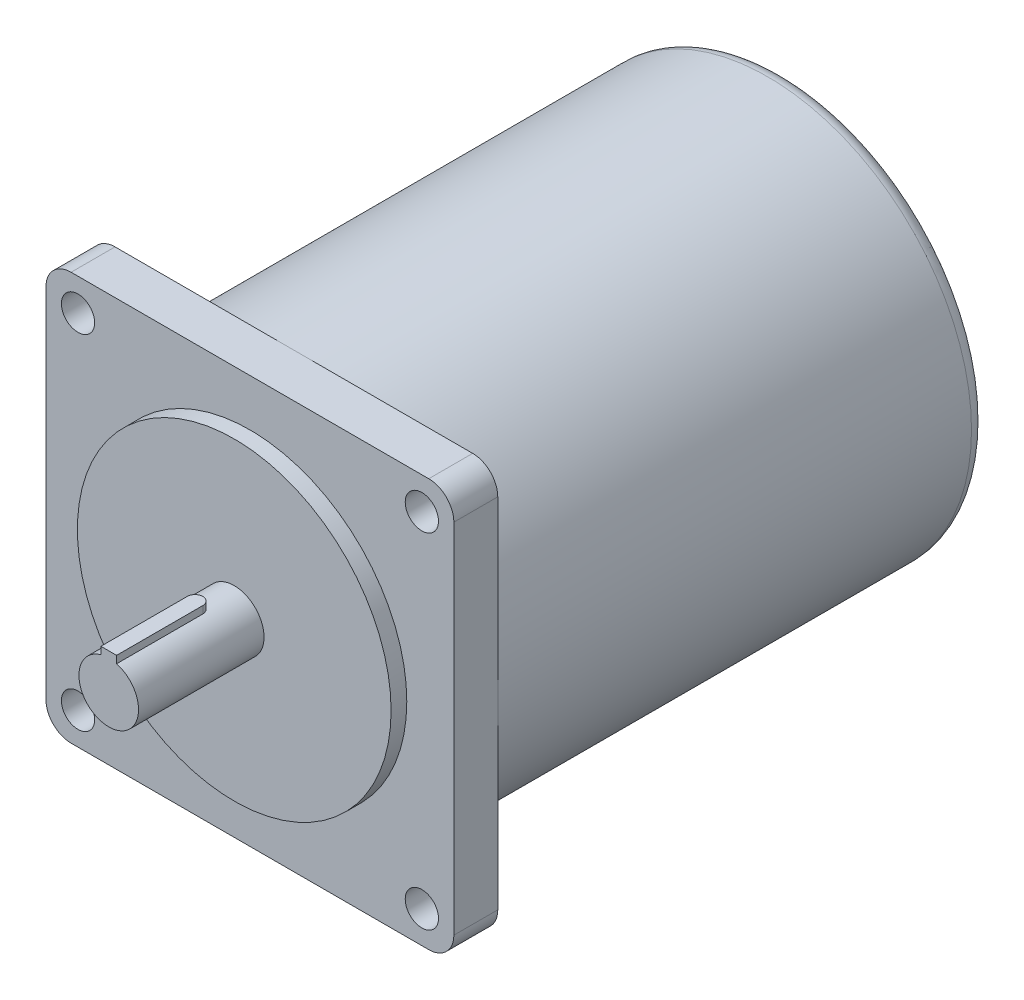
from build123d import *

# Parameters (mm, degrees)
SKETCH_1_R      = 50
EXTRUDE_1_DEPTH = 5
SKETCH_2_R      = 9.5
EXTRUDE_2_DEPTH = 40
EXTRUDE_3_DEPTH = 11.5
SKETCH_4_R      = 5.3
EXTRUDE_4_DEPTH = 14
SKETCH_6_R      = 65
EXTRUDE_5_DEPTH = 156
FILLET_1_R      = 5


with BuildPart() as part:
    # Sketch 1 → Extrude 1 (new body)
    with BuildSketch(Plane.XY):
        Circle(SKETCH_1_R)
    extrude(amount=-EXTRUDE_1_DEPTH)

    # Sketch 2 → Extrude 2 (add)
    with BuildSketch(Plane.XY):
        Circle(SKETCH_2_R)
    extrude(amount=EXTRUDE_2_DEPTH)

    # Sketch 3 → Extrude 3 (add)
    with BuildSketch(Plane(origin=(0, 0, 0), x_dir=(1, 0, 0), z_dir=(0, 1, 0))):
        with BuildLine():
            Line((-2.5, -12.5), (-2.5, -40))
            Line((-2.5, -40), (2.5, -40))
            Line((2.5, -40), (2.5, -12.5))
            ThreePointArc((2.5, -12.5), (0, -10), (-2.5, -12.5))
        make_face()
    extrude(amount=EXTRUDE_3_DEPTH)

    # Sketch 4 → Extrude 4 (add)
    with BuildSketch(Plane(origin=(0, 0, -5), x_dir=(-1, 0, 0), z_dir=(0, 0, -1))):
        with BuildLine():
            Line((0, 65), (57, 65))
            ThreePointArc((57, 65), (62.656854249, 62.656854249), (65, 57))
            Line((65, 57), (65, -57))
            ThreePointArc((65, -57), (62.656854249, -62.656854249), (57, -65))
            Line((57, -65), (-57, -65))
            ThreePointArc((-57, -65), (-62.656854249, -62.656854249), (-65, -57))
            Line((-65, -57), (-65, 57))
            ThreePointArc((-65, 57), (-62.656854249, 62.656854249), (-57, 65))
            Line((-57, 65), (0, 65))
        make_face()
        with Locations((-54.8, 54.8)):
            Circle(SKETCH_4_R, mode=Mode.SUBTRACT)
        with Locations((54.8, 54.8)):
            Circle(SKETCH_4_R, mode=Mode.SUBTRACT)
        with Locations((54.8, -54.8)):
            Circle(SKETCH_4_R, mode=Mode.SUBTRACT)
        with Locations((-54.8, -54.8)):
            Circle(SKETCH_4_R, mode=Mode.SUBTRACT)
    extrude(amount=EXTRUDE_4_DEPTH)

    # Sketch 6 → Extrude 5 (add)
    with BuildSketch(Plane(origin=(0, 0, -19), x_dir=(-1, 0, 0), z_dir=(0, 0, -1))):
        Circle(SKETCH_6_R)
    extrude(amount=EXTRUDE_5_DEPTH)

    # Fillet 1
    fillet_1_edges = [part.edges().sort_by_distance(p)[0] for p in [
        (65, 0, -175),
    ]]
    fillet(fillet_1_edges, radius=FILLET_1_R)


solid = part.part
